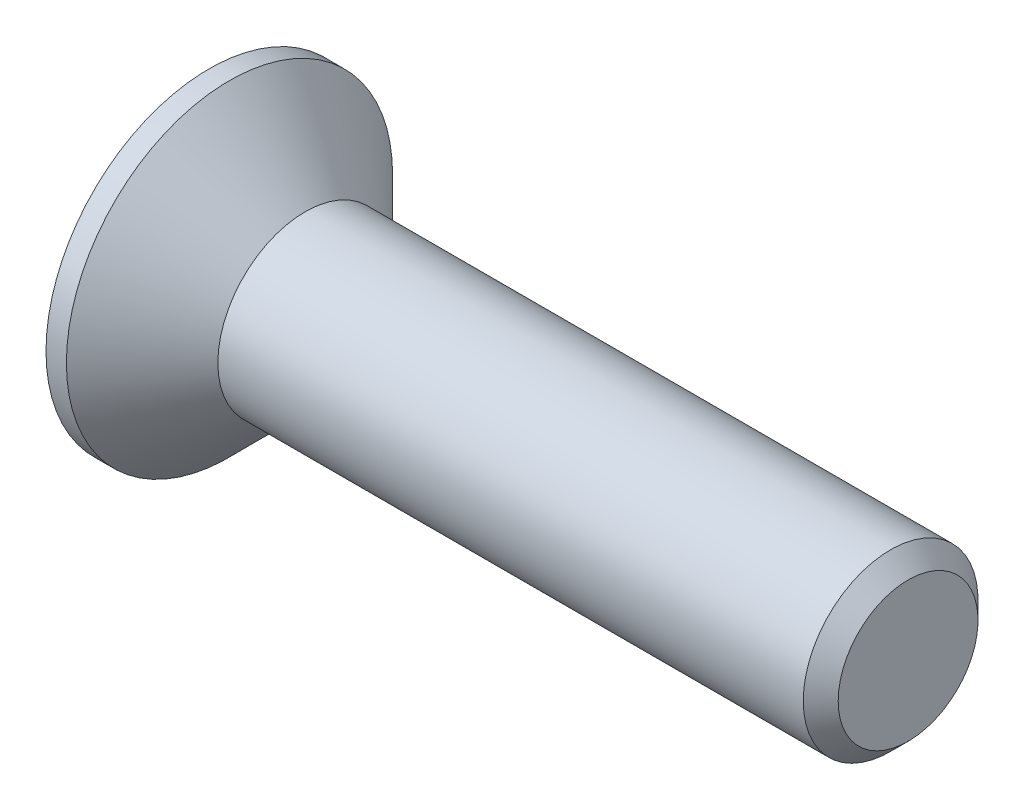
from build123d import *

# Parameters (mm, degrees)
CHAMFER1_SIZE      = 0.3
CUT_EXTRUDE1_DEPTH = 1.25


with BuildPart() as part:
    # Sketch1 → Revolve1 (revolve)
    with BuildSketch(Plane.XY, mode=Mode.PRIVATE) as revolve1_sk:
        Polygon((-1.65, 2.8), (-1.65, 0), (10.35, 0), (10.35, 1.5), (0, 1.5), (-1.3, 2.8), align=None)
    revolve(revolve1_sk.sketch.rotate(Axis((-1.65, 0, 0), (1, 0, 0)), 90), axis=Axis((-1.65, 0, 0), (1, 0, 0)))

    # Chamfer1
    chamfer1_edges = [part.edges().sort_by_distance(p)[0] for p in [
        (10.35, 0, -1.5),
    ]]
    chamfer(chamfer1_edges, length=CHAMFER1_SIZE)

    # Sketch2 → Cut-Extrude1 (cut)
    with BuildSketch(Plane.ZY.offset(1.65)):
        Polygon((-0.365, 1.45), (0.365, 1.45), (0.365, 0.365), (1.45, 0.365), (1.45, -0.365), (0.365, -0.365), (0.365, -1.45), (-0.365, -1.45), (-0.365, -0.365), (-1.45, -0.365), (-1.45, 0.365), (-0.365, 0.365), align=None)
    extrude(amount=-CUT_EXTRUDE1_DEPTH, mode=Mode.SUBTRACT)


solid = part.part
